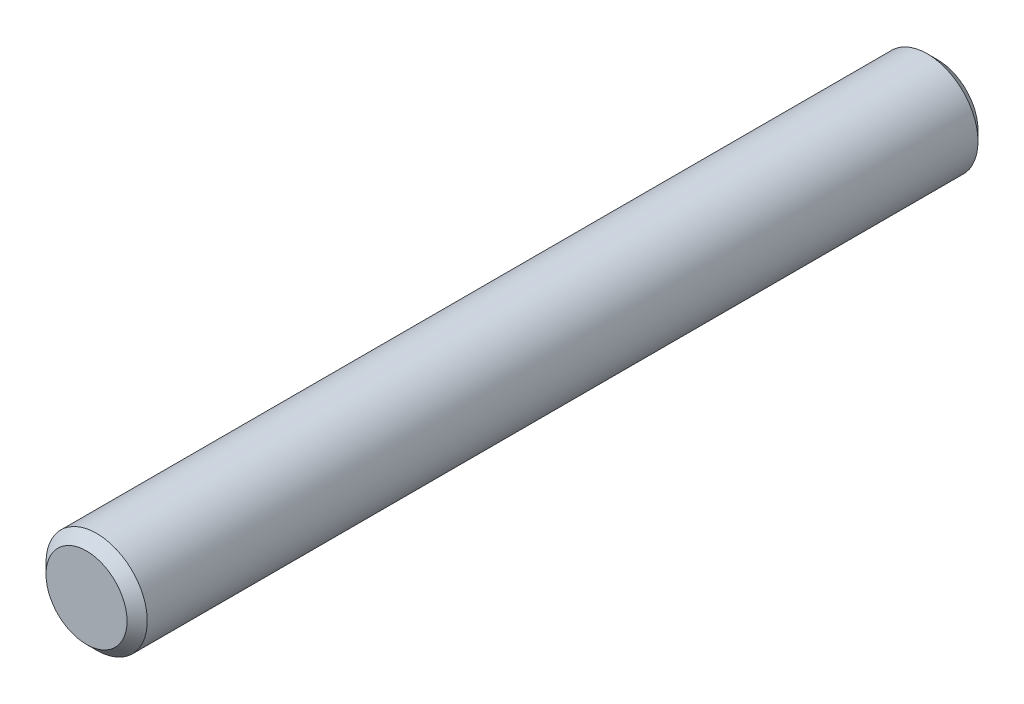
from build123d import *

# Parameters (mm, degrees)
ESQUISSE1_R          = 1.25
BASE_EXTRUSION_DEPTH = 21
CHANFREIN1_SIZE      = 0.25


with BuildPart() as part:
    # Esquisse1 → Base-Extrusion (new body)
    with BuildSketch(Plane.XY):
        with Locations(Location((0, 0, 0), (0, 0, 180))):
            Circle(ESQUISSE1_R)
    extrude(amount=BASE_EXTRUSION_DEPTH)

    # Chanfrein1
    chanfrein1_edges = [part.edges().sort_by_distance(p)[0] for p in [
        (1.25, 0, 0),
        (1.25, 0, 21),
    ]]
    chamfer(chanfrein1_edges, length=CHANFREIN1_SIZE)


solid = part.part
